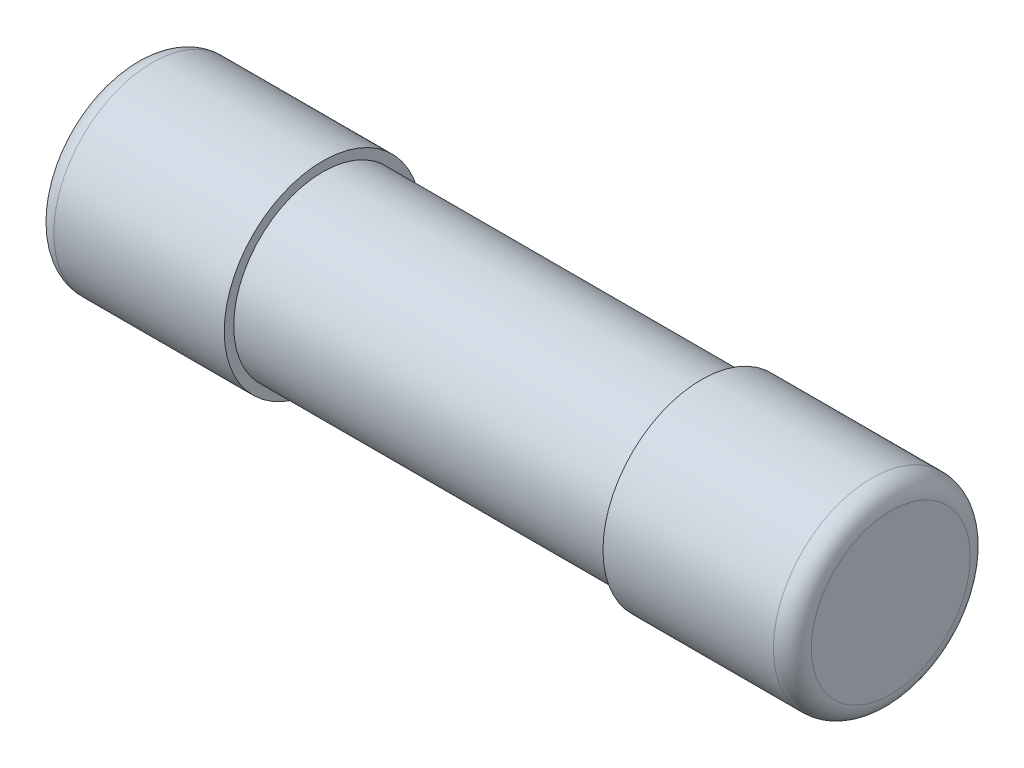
ISO-10303-21;
HEADER;
FILE_DESCRIPTION(('STEP AP214'),'2;1');
FILE_NAME('part.step','',(''),(''),'','','');
FILE_SCHEMA(('AUTOMOTIVE_DESIGN { 1 0 10303 214 1 1 1 1 }'));
ENDSEC;
DATA;
#1=APPLICATION_CONTEXT('core data for automotive mechanical design processes');
#2=APPLICATION_PROTOCOL_DEFINITION('international standard','automotive_design',2000,#1);
#3=PRODUCT_CONTEXT('',#1,'mechanical');
#4=PRODUCT('Part','Part','',(#3));
#5=PRODUCT_RELATED_PRODUCT_CATEGORY('part','',(#4));
#6=PRODUCT_DEFINITION_FORMATION('','',#4);
#7=PRODUCT_DEFINITION_CONTEXT('part definition',#1,'design');
#8=PRODUCT_DEFINITION('design','',#6,#7);
#9=PRODUCT_DEFINITION_SHAPE('','',#8);
#10=(LENGTH_UNIT() NAMED_UNIT(*) SI_UNIT(.MILLI.,.METRE.));
#11=(NAMED_UNIT(*) PLANE_ANGLE_UNIT() SI_UNIT($,.RADIAN.));
#12=(NAMED_UNIT(*) SI_UNIT($,.STERADIAN.) SOLID_ANGLE_UNIT());
#13=UNCERTAINTY_MEASURE_WITH_UNIT(LENGTH_MEASURE(1.E-05),#10,'distance_accuracy_value','');
#14=(GEOMETRIC_REPRESENTATION_CONTEXT(3) GLOBAL_UNCERTAINTY_ASSIGNED_CONTEXT((#13)) GLOBAL_UNIT_ASSIGNED_CONTEXT((#10,
#11,#12)) REPRESENTATION_CONTEXT('',''));
#15=CARTESIAN_POINT('',(0.,0.,0.));
#16=DIRECTION('',(0.,0.,1.));
#17=DIRECTION('',(1.,0.,0.));
#18=AXIS2_PLACEMENT_3D('',#15,#16,#17);
#19=CARTESIAN_POINT('',(-9.5,0.,0.));
#20=DIRECTION('',(-1.,0.,0.));
#21=DIRECTION('',(0.,0.,1.));
#22=AXIS2_PLACEMENT_3D('',#19,#20,#21);
#23=CYLINDRICAL_SURFACE('',#22,2.35);
#24=CARTESIAN_POINT('',(-5.,0.,0.));
#25=DIRECTION('',(-1.,0.,0.));
#26=DIRECTION('',(0.,0.,1.));
#27=AXIS2_PLACEMENT_3D('',#24,#25,#26);
#28=CIRCLE('',#27,2.35);
#29=CARTESIAN_POINT('',(-5.,0.,2.35));
#30=VERTEX_POINT('',#29);
#31=EDGE_CURVE('E48',#30,#30,#28,.T.);
#32=ORIENTED_EDGE('',*,*,#31,.F.);
#33=EDGE_LOOP('',(#32));
#34=FACE_BOUND('',#33,.T.);
#35=CARTESIAN_POINT('',(5.,0.,0.));
#36=DIRECTION('',(1.,0.,0.));
#37=DIRECTION('',(0.,0.,-1.));
#38=AXIS2_PLACEMENT_3D('',#35,#36,#37);
#39=CIRCLE('',#38,2.35);
#40=CARTESIAN_POINT('',(5.,0.,-2.35));
#41=VERTEX_POINT('',#40);
#42=EDGE_CURVE('E44',#41,#41,#39,.T.);
#43=ORIENTED_EDGE('',*,*,#42,.F.);
#44=EDGE_LOOP('',(#43));
#45=FACE_BOUND('',#44,.T.);
#46=ADVANCED_FACE('F32',(#34,#45),#23,.T.);
#47=CARTESIAN_POINT('',(-10.,2.1,0.));
#48=DIRECTION('',(1.,0.,0.));
#49=DIRECTION('',(0.,0.,-1.));
#50=AXIS2_PLACEMENT_3D('',#47,#48,#49);
#51=PLANE('',#50);
#52=CARTESIAN_POINT('',(-10.,0.,0.));
#53=DIRECTION('',(-1.,0.,0.));
#54=DIRECTION('',(0.,0.,1.));
#55=AXIS2_PLACEMENT_3D('',#52,#53,#54);
#56=CIRCLE('',#55,2.1);
#57=CARTESIAN_POINT('',(-10.,0.,2.1));
#58=VERTEX_POINT('',#57);
#59=EDGE_CURVE('E65',#58,#58,#56,.T.);
#60=ORIENTED_EDGE('',*,*,#59,.T.);
#61=EDGE_LOOP('',(#60));
#62=FACE_BOUND('',#61,.T.);
#63=ADVANCED_FACE('F98',(#62),#51,.F.);
#64=CARTESIAN_POINT('',(-9.5,0.,0.));
#65=DIRECTION('',(-1.,0.,0.));
#66=DIRECTION('',(0.,0.,1.));
#67=AXIS2_PLACEMENT_3D('',#64,#65,#66);
#68=TOROIDAL_SURFACE('',#67,2.1,0.499999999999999);
#69=ORIENTED_EDGE('',*,*,#59,.F.);
#70=EDGE_LOOP('',(#69));
#71=FACE_BOUND('',#70,.T.);
#72=CARTESIAN_POINT('',(-9.5,0.,0.));
#73=DIRECTION('',(-1.,0.,0.));
#74=DIRECTION('',(0.,0.,1.));
#75=AXIS2_PLACEMENT_3D('',#72,#73,#74);
#76=CIRCLE('',#75,2.6);
#77=CARTESIAN_POINT('',(-9.5,0.,2.6));
#78=VERTEX_POINT('',#77);
#79=EDGE_CURVE('E62',#78,#78,#76,.T.);
#80=ORIENTED_EDGE('',*,*,#79,.T.);
#81=EDGE_LOOP('',(#80));
#82=FACE_BOUND('',#81,.T.);
#83=ADVANCED_FACE('F103',(#71,#82),#68,.T.);
#84=CARTESIAN_POINT('',(-9.5,0.,0.));
#85=DIRECTION('',(-1.,0.,0.));
#86=DIRECTION('',(0.,0.,1.));
#87=AXIS2_PLACEMENT_3D('',#84,#85,#86);
#88=CYLINDRICAL_SURFACE('',#87,2.6);
#89=ORIENTED_EDGE('',*,*,#79,.F.);
#90=EDGE_LOOP('',(#89));
#91=FACE_BOUND('',#90,.T.);
#92=CARTESIAN_POINT('',(-5.,0.,0.));
#93=DIRECTION('',(-1.,0.,0.));
#94=DIRECTION('',(0.,0.,1.));
#95=AXIS2_PLACEMENT_3D('',#92,#93,#94);
#96=CIRCLE('',#95,2.6);
#97=CARTESIAN_POINT('',(-5.,0.,2.6));
#98=VERTEX_POINT('',#97);
#99=EDGE_CURVE('E59',#98,#98,#96,.T.);
#100=ORIENTED_EDGE('',*,*,#99,.T.);
#101=EDGE_LOOP('',(#100));
#102=FACE_BOUND('',#101,.T.);
#103=ADVANCED_FACE('F117',(#91,#102),#88,.T.);
#104=CARTESIAN_POINT('',(-5.,2.35,0.));
#105=DIRECTION('',(-1.,0.,0.));
#106=DIRECTION('',(0.,0.,1.));
#107=AXIS2_PLACEMENT_3D('',#104,#105,#106);
#108=PLANE('',#107);
#109=ORIENTED_EDGE('',*,*,#99,.F.);
#110=EDGE_LOOP('',(#109));
#111=FACE_BOUND('',#110,.T.);
#112=ORIENTED_EDGE('',*,*,#31,.T.);
#113=EDGE_LOOP('',(#112));
#114=FACE_BOUND('',#113,.T.);
#115=ADVANCED_FACE('F84',(#111,#114),#108,.F.);
#116=CARTESIAN_POINT('',(9.5,0.,0.));
#117=DIRECTION('',(-1.,0.,0.));
#118=DIRECTION('',(0.,0.,1.));
#119=AXIS2_PLACEMENT_3D('',#116,#117,#118);
#120=TOROIDAL_SURFACE('',#119,2.1,0.499999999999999);
#121=CARTESIAN_POINT('',(9.5,0.,0.));
#122=DIRECTION('',(-1.,0.,0.));
#123=DIRECTION('',(0.,0.,1.));
#124=AXIS2_PLACEMENT_3D('',#121,#122,#123);
#125=CIRCLE('',#124,2.6);
#126=CARTESIAN_POINT('',(9.5,0.,2.6));
#127=VERTEX_POINT('',#126);
#128=EDGE_CURVE('E74',#127,#127,#125,.T.);
#129=ORIENTED_EDGE('',*,*,#128,.F.);
#130=EDGE_LOOP('',(#129));
#131=FACE_BOUND('',#130,.T.);
#132=CARTESIAN_POINT('',(10.,0.,0.));
#133=DIRECTION('',(-1.,0.,0.));
#134=DIRECTION('',(0.,0.,1.));
#135=AXIS2_PLACEMENT_3D('',#132,#133,#134);
#136=CIRCLE('',#135,2.1);
#137=CARTESIAN_POINT('',(10.,0.,2.1));
#138=VERTEX_POINT('',#137);
#139=EDGE_CURVE('E68',#138,#138,#136,.T.);
#140=ORIENTED_EDGE('',*,*,#139,.T.);
#141=EDGE_LOOP('',(#140));
#142=FACE_BOUND('',#141,.T.);
#143=ADVANCED_FACE('F80',(#131,#142),#120,.T.);
#144=CARTESIAN_POINT('',(10.,2.1,0.));
#145=DIRECTION('',(-1.,0.,0.));
#146=DIRECTION('',(0.,0.,1.));
#147=AXIS2_PLACEMENT_3D('',#144,#145,#146);
#148=PLANE('',#147);
#149=ORIENTED_EDGE('',*,*,#139,.F.);
#150=EDGE_LOOP('',(#149));
#151=FACE_BOUND('',#150,.T.);
#152=ADVANCED_FACE('F83',(#151),#148,.F.);
#153=CARTESIAN_POINT('',(5.,2.35,0.));
#154=DIRECTION('',(1.,0.,0.));
#155=DIRECTION('',(0.,0.,-1.));
#156=AXIS2_PLACEMENT_3D('',#153,#154,#155);
#157=PLANE('',#156);
#158=ORIENTED_EDGE('',*,*,#42,.T.);
#159=EDGE_LOOP('',(#158));
#160=FACE_BOUND('',#159,.T.);
#161=CARTESIAN_POINT('',(5.,0.,0.));
#162=DIRECTION('',(-1.,0.,0.));
#163=DIRECTION('',(0.,0.,1.));
#164=AXIS2_PLACEMENT_3D('',#161,#162,#163);
#165=CIRCLE('',#164,2.6);
#166=CARTESIAN_POINT('',(5.,0.,2.6));
#167=VERTEX_POINT('',#166);
#168=EDGE_CURVE('E71',#167,#167,#165,.T.);
#169=ORIENTED_EDGE('',*,*,#168,.T.);
#170=EDGE_LOOP('',(#169));
#171=FACE_BOUND('',#170,.T.);
#172=ADVANCED_FACE('F89',(#160,#171),#157,.F.);
#173=CARTESIAN_POINT('',(-9.5,0.,0.));
#174=DIRECTION('',(-1.,0.,0.));
#175=DIRECTION('',(0.,0.,1.));
#176=AXIS2_PLACEMENT_3D('',#173,#174,#175);
#177=CYLINDRICAL_SURFACE('',#176,2.6);
#178=ORIENTED_EDGE('',*,*,#168,.F.);
#179=EDGE_LOOP('',(#178));
#180=FACE_BOUND('',#179,.T.);
#181=ORIENTED_EDGE('',*,*,#128,.T.);
#182=EDGE_LOOP('',(#181));
#183=FACE_BOUND('',#182,.T.);
#184=ADVANCED_FACE('F78',(#180,#183),#177,.T.);
#185=CLOSED_SHELL('',(#46,#63,#83,#103,#115,#143,#152,#172,#184));
#186=CARTESIAN_POINT('',(9.5,2.35,0.));
#187=DIRECTION('',(1.,0.,0.));
#188=DIRECTION('',(0.,0.,-1.));
#189=AXIS2_PLACEMENT_3D('',#186,#187,#188);
#190=PLANE('',#189);
#191=CARTESIAN_POINT('',(9.5,0.,0.));
#192=DIRECTION('',(-1.,0.,0.));
#193=DIRECTION('',(0.,0.,1.));
#194=AXIS2_PLACEMENT_3D('',#191,#192,#193);
#195=CIRCLE('',#194,2.15);
#196=CARTESIAN_POINT('',(9.5,0.,2.15));
#197=VERTEX_POINT('',#196);
#198=EDGE_CURVE('E53',#197,#197,#195,.T.);
#199=ORIENTED_EDGE('',*,*,#198,.T.);
#200=EDGE_LOOP('',(#199));
#201=FACE_BOUND('',#200,.T.);
#202=CARTESIAN_POINT('',(9.5,0.,0.));
#203=DIRECTION('',(1.,0.,0.));
#204=DIRECTION('',(0.,0.,-1.));
#205=AXIS2_PLACEMENT_3D('',#202,#203,#204);
#206=CIRCLE('',#205,0.05);
#207=CARTESIAN_POINT('',(9.5,0.,-0.05));
#208=VERTEX_POINT('',#207);
#209=EDGE_CURVE('E10',#208,#208,#206,.F.);
#210=ORIENTED_EDGE('',*,*,#209,.F.);
#211=EDGE_LOOP('',(#210));
#212=FACE_BOUND('',#211,.T.);
#213=ADVANCED_FACE('F112',(#201,#212),#190,.F.);
#214=CARTESIAN_POINT('',(-9.5,2.35,0.));
#215=DIRECTION('',(-1.,0.,0.));
#216=DIRECTION('',(0.,0.,1.));
#217=AXIS2_PLACEMENT_3D('',#214,#215,#216);
#218=PLANE('',#217);
#219=CARTESIAN_POINT('',(-9.5,0.,0.));
#220=DIRECTION('',(-1.,0.,0.));
#221=DIRECTION('',(0.,0.,1.));
#222=AXIS2_PLACEMENT_3D('',#219,#220,#221);
#223=CIRCLE('',#222,2.15);
#224=CARTESIAN_POINT('',(-9.5,0.,2.15));
#225=VERTEX_POINT('',#224);
#226=EDGE_CURVE('E56',#225,#225,#223,.F.);
#227=ORIENTED_EDGE('',*,*,#226,.T.);
#228=EDGE_LOOP('',(#227));
#229=FACE_BOUND('',#228,.T.);
#230=CARTESIAN_POINT('',(-9.5,0.,0.));
#231=DIRECTION('',(-1.,0.,0.));
#232=DIRECTION('',(0.,0.,1.));
#233=AXIS2_PLACEMENT_3D('',#230,#231,#232);
#234=CIRCLE('',#233,0.05);
#235=CARTESIAN_POINT('',(-9.5,0.,0.05));
#236=VERTEX_POINT('',#235);
#237=EDGE_CURVE('E40',#236,#236,#234,.F.);
#238=ORIENTED_EDGE('',*,*,#237,.F.);
#239=EDGE_LOOP('',(#238));
#240=FACE_BOUND('',#239,.T.);
#241=ADVANCED_FACE('F109',(#229,#240),#218,.F.);
#242=CARTESIAN_POINT('',(-9.5,0.,0.));
#243=DIRECTION('',(-1.,0.,0.));
#244=DIRECTION('',(0.,0.,1.));
#245=AXIS2_PLACEMENT_3D('',#242,#243,#244);
#246=CYLINDRICAL_SURFACE('',#245,2.15);
#247=ORIENTED_EDGE('',*,*,#198,.F.);
#248=EDGE_LOOP('',(#247));
#249=FACE_BOUND('',#248,.T.);
#250=ORIENTED_EDGE('',*,*,#226,.F.);
#251=EDGE_LOOP('',(#250));
#252=FACE_BOUND('',#251,.T.);
#253=ADVANCED_FACE('F34',(#249,#252),#246,.F.);
#254=CARTESIAN_POINT('',(9.64142135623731,0.,0.));
#255=DIRECTION('',(-1.,0.,0.));
#256=DIRECTION('',(0.,0.,1.));
#257=AXIS2_PLACEMENT_3D('',#254,#255,#256);
#258=CYLINDRICAL_SURFACE('',#257,0.05);
#259=ORIENTED_EDGE('',*,*,#209,.T.);
#260=EDGE_LOOP('',(#259));
#261=FACE_BOUND('',#260,.T.);
#262=ORIENTED_EDGE('',*,*,#237,.T.);
#263=EDGE_LOOP('',(#262));
#264=FACE_BOUND('',#263,.T.);
#265=ADVANCED_FACE('F186',(#261,#264),#258,.T.);
#266=CLOSED_SHELL('',(#213,#241,#253,#265));
#267=ORIENTED_CLOSED_SHELL('',*,#266,.T.);
#268=BREP_WITH_VOIDS('B2',#185,(#267));
#269=ADVANCED_BREP_SHAPE_REPRESENTATION('',(#18,#268),#14);
#270=SHAPE_DEFINITION_REPRESENTATION(#9,#269);
ENDSEC;
END-ISO-10303-21;
